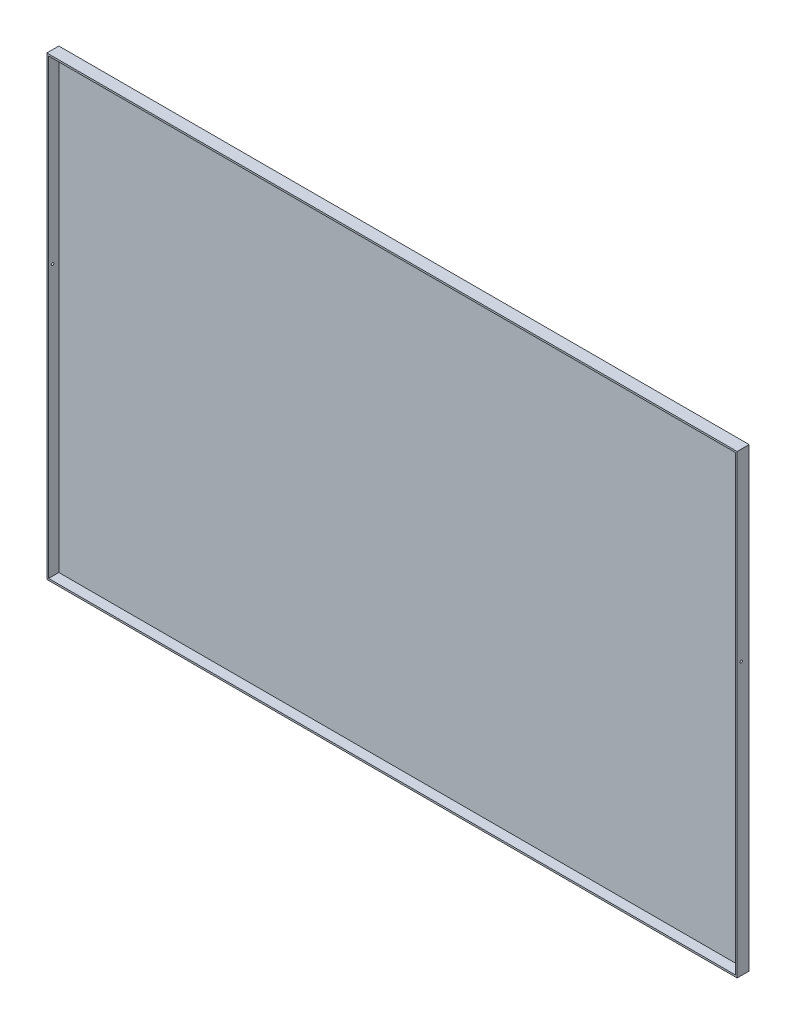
from build123d import *

# Parameters (mm, degrees)
ESQUISSE2_W             = 1726
ESQUISSE2_H             = 1140
BOSS_EXTRU_1_DEPTH      = 30
COQUE1_T                = -4.4
ESQUISSE3_R             = 3
ENL_V_MAT_EXTRU_1_DEPTH = 1818.9317919


with BuildPart() as part:
    # Esquisse2 → Boss.-Extru.1 (new body)
    with BuildSketch(Plane.XY):
        Rectangle(ESQUISSE2_W, ESQUISSE2_H)
    extrude(amount=BOSS_EXTRU_1_DEPTH)

    # Coque1
    coque1_openings = [part.faces().sort_by_distance(p)[0] for p in [
        (0, 0, 30),
    ]]
    offset(amount=COQUE1_T, openings=coque1_openings, kind=Kind.INTERSECTION)

    # Esquisse3 → Enl_v. mat.-Extru.1 (cut, through all)
    with BuildSketch(Plane.ZY.offset(863)):
        with Locations((20, 110)):
            Circle(ESQUISSE3_R)
    extrude(amount=-ENL_V_MAT_EXTRU_1_DEPTH, mode=Mode.SUBTRACT)


solid = part.part
